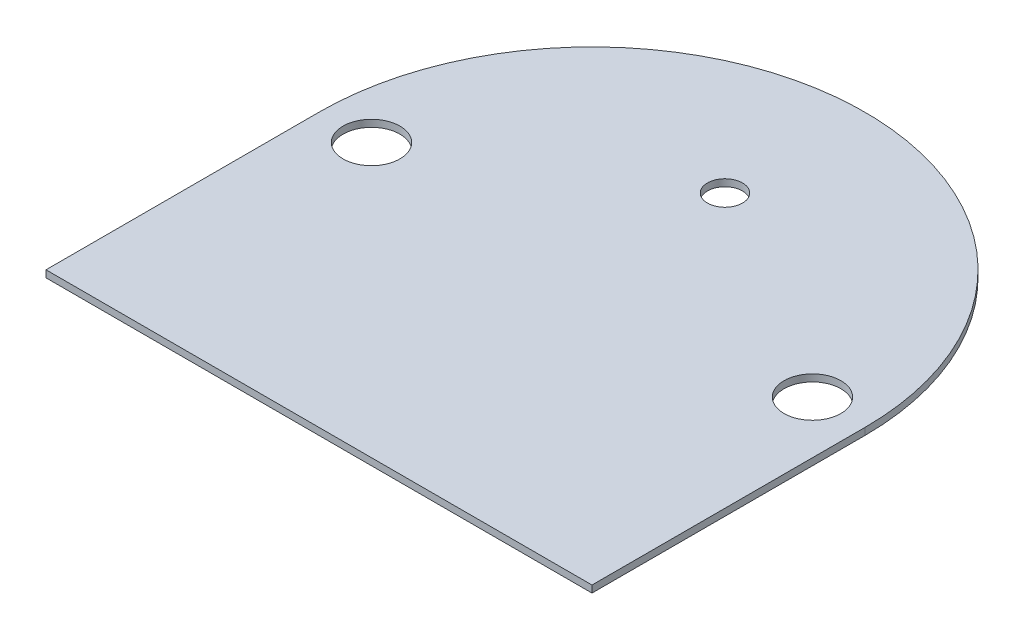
ISO-10303-21;
HEADER;
FILE_DESCRIPTION(('STEP AP214'),'2;1');
FILE_NAME('part.step','',(''),(''),'','','');
FILE_SCHEMA(('AUTOMOTIVE_DESIGN { 1 0 10303 214 1 1 1 1 }'));
ENDSEC;
DATA;
#1=APPLICATION_CONTEXT('core data for automotive mechanical design processes');
#2=APPLICATION_PROTOCOL_DEFINITION('international standard','automotive_design',2000,#1);
#3=PRODUCT_CONTEXT('',#1,'mechanical');
#4=PRODUCT('Part','Part','',(#3));
#5=PRODUCT_RELATED_PRODUCT_CATEGORY('part','',(#4));
#6=PRODUCT_DEFINITION_FORMATION('','',#4);
#7=PRODUCT_DEFINITION_CONTEXT('part definition',#1,'design');
#8=PRODUCT_DEFINITION('design','',#6,#7);
#9=PRODUCT_DEFINITION_SHAPE('','',#8);
#10=(LENGTH_UNIT() NAMED_UNIT(*) SI_UNIT(.MILLI.,.METRE.));
#11=(NAMED_UNIT(*) PLANE_ANGLE_UNIT() SI_UNIT($,.RADIAN.));
#12=(NAMED_UNIT(*) SI_UNIT($,.STERADIAN.) SOLID_ANGLE_UNIT());
#13=UNCERTAINTY_MEASURE_WITH_UNIT(LENGTH_MEASURE(1.E-05),#10,'distance_accuracy_value','');
#14=(GEOMETRIC_REPRESENTATION_CONTEXT(3) GLOBAL_UNCERTAINTY_ASSIGNED_CONTEXT((#13)) GLOBAL_UNIT_ASSIGNED_CONTEXT((#10,
#11,#12)) REPRESENTATION_CONTEXT('',''));
#15=CARTESIAN_POINT('',(0.,0.,0.));
#16=DIRECTION('',(0.,0.,1.));
#17=DIRECTION('',(1.,0.,0.));
#18=AXIS2_PLACEMENT_3D('',#15,#16,#17);
#19=CARTESIAN_POINT('',(0.,2.54,0.));
#20=DIRECTION('',(0.,-1.,0.));
#21=DIRECTION('',(0.,0.,-1.));
#22=AXIS2_PLACEMENT_3D('',#19,#20,#21);
#23=CYLINDRICAL_SURFACE('',#22,99.06);
#24=CARTESIAN_POINT('',(0.,0.,0.));
#25=DIRECTION('',(0.,1.,0.));
#26=DIRECTION('',(0.,0.,1.));
#27=AXIS2_PLACEMENT_3D('',#24,#25,#26);
#28=CIRCLE('',#27,99.06);
#29=CARTESIAN_POINT('',(99.06,0.,0.));
#30=VERTEX_POINT('',#29);
#31=CARTESIAN_POINT('',(-99.06,0.,0.));
#32=VERTEX_POINT('',#31);
#33=EDGE_CURVE('E108',#30,#32,#28,.T.);
#34=ORIENTED_EDGE('',*,*,#33,.T.);
#35=DIRECTION('',(0.,-1.,0.));
#36=VECTOR('',#35,1.);
#37=CARTESIAN_POINT('',(-99.06,2.54,0.));
#38=LINE('',#37,#36);
#39=CARTESIAN_POINT('',(-99.06,2.54,0.));
#40=VERTEX_POINT('',#39);
#41=EDGE_CURVE('E11',#40,#32,#38,.T.);
#42=ORIENTED_EDGE('',*,*,#41,.F.);
#43=CARTESIAN_POINT('',(0.,2.54,0.));
#44=DIRECTION('',(0.,1.,0.));
#45=DIRECTION('',(0.,0.,1.));
#46=AXIS2_PLACEMENT_3D('',#43,#44,#45);
#47=CIRCLE('',#46,99.06);
#48=CARTESIAN_POINT('',(99.06,2.54,0.));
#49=VERTEX_POINT('',#48);
#50=EDGE_CURVE('E94',#49,#40,#47,.T.);
#51=ORIENTED_EDGE('',*,*,#50,.F.);
#52=DIRECTION('',(0.,-1.,0.));
#53=VECTOR('',#52,1.);
#54=CARTESIAN_POINT('',(99.06,2.54,0.));
#55=LINE('',#54,#53);
#56=EDGE_CURVE('E61',#49,#30,#55,.T.);
#57=ORIENTED_EDGE('',*,*,#56,.T.);
#58=EDGE_LOOP('',(#34,#42,#51,#57));
#59=FACE_BOUND('',#58,.T.);
#60=ADVANCED_FACE('F45',(#59),#23,.T.);
#61=CARTESIAN_POINT('',(-99.06,2.54,0.));
#62=DIRECTION('',(1.,0.,0.));
#63=DIRECTION('',(0.,0.,-1.));
#64=AXIS2_PLACEMENT_3D('',#61,#62,#63);
#65=PLANE('',#64);
#66=DIRECTION('',(0.,0.,1.));
#67=VECTOR('',#66,1.);
#68=CARTESIAN_POINT('',(-99.06,0.,0.));
#69=LINE('',#68,#67);
#70=CARTESIAN_POINT('',(-99.06,0.,99.06));
#71=VERTEX_POINT('',#70);
#72=EDGE_CURVE('E99',#32,#71,#69,.T.);
#73=ORIENTED_EDGE('',*,*,#72,.T.);
#74=DIRECTION('',(0.,-1.,0.));
#75=VECTOR('',#74,1.);
#76=CARTESIAN_POINT('',(-99.06,2.54,99.06));
#77=LINE('',#76,#75);
#78=CARTESIAN_POINT('',(-99.06,2.54,99.06));
#79=VERTEX_POINT('',#78);
#80=EDGE_CURVE('E53',#79,#71,#77,.T.);
#81=ORIENTED_EDGE('',*,*,#80,.F.);
#82=DIRECTION('',(0.,0.,1.));
#83=VECTOR('',#82,1.);
#84=CARTESIAN_POINT('',(-99.06,2.54,0.));
#85=LINE('',#84,#83);
#86=EDGE_CURVE('E87',#40,#79,#85,.T.);
#87=ORIENTED_EDGE('',*,*,#86,.F.);
#88=ORIENTED_EDGE('',*,*,#41,.T.);
#89=EDGE_LOOP('',(#73,#81,#87,#88));
#90=FACE_BOUND('',#89,.T.);
#91=ADVANCED_FACE('F98',(#90),#65,.F.);
#92=CARTESIAN_POINT('',(0.,2.54,99.06));
#93=DIRECTION('',(0.,0.,-1.));
#94=DIRECTION('',(-1.,0.,0.));
#95=AXIS2_PLACEMENT_3D('',#92,#93,#94);
#96=PLANE('',#95);
#97=DIRECTION('',(1.,0.,0.));
#98=VECTOR('',#97,1.);
#99=CARTESIAN_POINT('',(0.,0.,99.06));
#100=LINE('',#99,#98);
#101=CARTESIAN_POINT('',(99.06,0.,99.06));
#102=VERTEX_POINT('',#101);
#103=EDGE_CURVE('E112',#71,#102,#100,.T.);
#104=ORIENTED_EDGE('',*,*,#103,.T.);
#105=DIRECTION('',(0.,-1.,0.));
#106=VECTOR('',#105,1.);
#107=CARTESIAN_POINT('',(99.06,2.54,99.06));
#108=LINE('',#107,#106);
#109=CARTESIAN_POINT('',(99.06,2.54,99.06));
#110=VERTEX_POINT('',#109);
#111=EDGE_CURVE('E76',#110,#102,#108,.T.);
#112=ORIENTED_EDGE('',*,*,#111,.F.);
#113=DIRECTION('',(1.,0.,0.));
#114=VECTOR('',#113,1.);
#115=CARTESIAN_POINT('',(0.,2.54,99.06));
#116=LINE('',#115,#114);
#117=EDGE_CURVE('E93',#79,#110,#116,.T.);
#118=ORIENTED_EDGE('',*,*,#117,.F.);
#119=ORIENTED_EDGE('',*,*,#80,.T.);
#120=EDGE_LOOP('',(#104,#112,#118,#119));
#121=FACE_BOUND('',#120,.T.);
#122=ADVANCED_FACE('F102',(#121),#96,.F.);
#123=CARTESIAN_POINT('',(99.06,2.54,0.));
#124=DIRECTION('',(1.,0.,0.));
#125=DIRECTION('',(0.,0.,-1.));
#126=AXIS2_PLACEMENT_3D('',#123,#124,#125);
#127=PLANE('',#126);
#128=DIRECTION('',(0.,0.,1.));
#129=VECTOR('',#128,1.);
#130=CARTESIAN_POINT('',(99.06,0.,0.));
#131=LINE('',#130,#129);
#132=EDGE_CURVE('E114',#30,#102,#131,.T.);
#133=ORIENTED_EDGE('',*,*,#132,.F.);
#134=ORIENTED_EDGE('',*,*,#56,.F.);
#135=DIRECTION('',(0.,0.,1.));
#136=VECTOR('',#135,1.);
#137=CARTESIAN_POINT('',(99.06,2.54,0.));
#138=LINE('',#137,#136);
#139=EDGE_CURVE('E103',#49,#110,#138,.T.);
#140=ORIENTED_EDGE('',*,*,#139,.T.);
#141=ORIENTED_EDGE('',*,*,#111,.T.);
#142=EDGE_LOOP('',(#133,#134,#140,#141));
#143=FACE_BOUND('',#142,.T.);
#144=ADVANCED_FACE('F150',(#143),#127,.T.);
#145=CARTESIAN_POINT('',(0.,2.54,0.));
#146=DIRECTION('',(0.,1.,0.));
#147=DIRECTION('',(0.,0.,1.));
#148=AXIS2_PLACEMENT_3D('',#145,#146,#147);
#149=PLANE('',#148);
#150=CARTESIAN_POINT('',(-80.01,2.54,0.));
#151=DIRECTION('',(0.,1.,0.));
#152=DIRECTION('',(0.,0.,1.));
#153=AXIS2_PLACEMENT_3D('',#150,#151,#152);
#154=CIRCLE('',#153,10.31875);
#155=CARTESIAN_POINT('',(-80.01,2.54,10.31875));
#156=VERTEX_POINT('',#155);
#157=EDGE_CURVE('E132',#156,#156,#154,.T.);
#158=ORIENTED_EDGE('',*,*,#157,.F.);
#159=EDGE_LOOP('',(#158));
#160=FACE_BOUND('',#159,.T.);
#161=CARTESIAN_POINT('',(80.01,2.54,0.));
#162=DIRECTION('',(0.,1.,0.));
#163=DIRECTION('',(0.,0.,-1.));
#164=AXIS2_PLACEMENT_3D('',#161,#162,#163);
#165=CIRCLE('',#164,10.31875);
#166=CARTESIAN_POINT('',(80.01,2.54,-10.31875));
#167=VERTEX_POINT('',#166);
#168=EDGE_CURVE('E129',#167,#167,#165,.T.);
#169=ORIENTED_EDGE('',*,*,#168,.F.);
#170=EDGE_LOOP('',(#169));
#171=FACE_BOUND('',#170,.T.);
#172=CARTESIAN_POINT('',(0.,2.54,-48.26));
#173=DIRECTION('',(0.,1.,0.));
#174=DIRECTION('',(0.,0.,1.));
#175=AXIS2_PLACEMENT_3D('',#172,#173,#174);
#176=CIRCLE('',#175,6.35);
#177=CARTESIAN_POINT('',(0.,2.54,-41.91));
#178=VERTEX_POINT('',#177);
#179=EDGE_CURVE('E123',#178,#178,#176,.T.);
#180=ORIENTED_EDGE('',*,*,#179,.F.);
#181=EDGE_LOOP('',(#180));
#182=FACE_BOUND('',#181,.T.);
#183=ORIENTED_EDGE('',*,*,#50,.T.);
#184=ORIENTED_EDGE('',*,*,#86,.T.);
#185=ORIENTED_EDGE('',*,*,#117,.T.);
#186=ORIENTED_EDGE('',*,*,#139,.F.);
#187=EDGE_LOOP('',(#183,#184,#185,#186));
#188=FACE_BOUND('',#187,.T.);
#189=ADVANCED_FACE('F90',(#160,#171,#182,#188),#149,.T.);
#190=CARTESIAN_POINT('',(0.,0.,0.));
#191=DIRECTION('',(0.,1.,0.));
#192=DIRECTION('',(0.,0.,1.));
#193=AXIS2_PLACEMENT_3D('',#190,#191,#192);
#194=PLANE('',#193);
#195=CARTESIAN_POINT('',(-80.01,0.,0.));
#196=DIRECTION('',(0.,1.,0.));
#197=DIRECTION('',(0.,0.,1.));
#198=AXIS2_PLACEMENT_3D('',#195,#196,#197);
#199=CIRCLE('',#198,10.31875);
#200=CARTESIAN_POINT('',(-80.01,0.,10.31875));
#201=VERTEX_POINT('',#200);
#202=EDGE_CURVE('E110',#201,#201,#199,.T.);
#203=ORIENTED_EDGE('',*,*,#202,.T.);
#204=EDGE_LOOP('',(#203));
#205=FACE_BOUND('',#204,.T.);
#206=CARTESIAN_POINT('',(80.01,0.,0.));
#207=DIRECTION('',(0.,1.,0.));
#208=DIRECTION('',(0.,0.,-1.));
#209=AXIS2_PLACEMENT_3D('',#206,#207,#208);
#210=CIRCLE('',#209,10.31875);
#211=CARTESIAN_POINT('',(80.01,0.,-10.31875));
#212=VERTEX_POINT('',#211);
#213=EDGE_CURVE('E126',#212,#212,#210,.T.);
#214=ORIENTED_EDGE('',*,*,#213,.T.);
#215=EDGE_LOOP('',(#214));
#216=FACE_BOUND('',#215,.T.);
#217=CARTESIAN_POINT('',(0.,0.,-48.26));
#218=DIRECTION('',(0.,1.,0.));
#219=DIRECTION('',(0.,0.,1.));
#220=AXIS2_PLACEMENT_3D('',#217,#218,#219);
#221=CIRCLE('',#220,6.35);
#222=CARTESIAN_POINT('',(0.,0.,-41.91));
#223=VERTEX_POINT('',#222);
#224=EDGE_CURVE('E120',#223,#223,#221,.T.);
#225=ORIENTED_EDGE('',*,*,#224,.T.);
#226=EDGE_LOOP('',(#225));
#227=FACE_BOUND('',#226,.T.);
#228=ORIENTED_EDGE('',*,*,#33,.F.);
#229=ORIENTED_EDGE('',*,*,#132,.T.);
#230=ORIENTED_EDGE('',*,*,#103,.F.);
#231=ORIENTED_EDGE('',*,*,#72,.F.);
#232=EDGE_LOOP('',(#228,#229,#230,#231));
#233=FACE_BOUND('',#232,.T.);
#234=ADVANCED_FACE('F138',(#205,#216,#227,#233),#194,.F.);
#235=CARTESIAN_POINT('',(0.,0.,-48.26));
#236=DIRECTION('',(0.,1.,0.));
#237=DIRECTION('',(0.,0.,1.));
#238=AXIS2_PLACEMENT_3D('',#235,#236,#237);
#239=CYLINDRICAL_SURFACE('',#238,6.35);
#240=ORIENTED_EDGE('',*,*,#224,.F.);
#241=EDGE_LOOP('',(#240));
#242=FACE_BOUND('',#241,.T.);
#243=ORIENTED_EDGE('',*,*,#179,.T.);
#244=EDGE_LOOP('',(#243));
#245=FACE_BOUND('',#244,.T.);
#246=ADVANCED_FACE('F156',(#242,#245),#239,.F.);
#247=CARTESIAN_POINT('',(80.01,0.,0.));
#248=DIRECTION('',(0.,1.,0.));
#249=DIRECTION('',(0.,0.,1.));
#250=AXIS2_PLACEMENT_3D('',#247,#248,#249);
#251=CYLINDRICAL_SURFACE('',#250,10.31875);
#252=ORIENTED_EDGE('',*,*,#213,.F.);
#253=EDGE_LOOP('',(#252));
#254=FACE_BOUND('',#253,.T.);
#255=ORIENTED_EDGE('',*,*,#168,.T.);
#256=EDGE_LOOP('',(#255));
#257=FACE_BOUND('',#256,.T.);
#258=ADVANCED_FACE('F144',(#254,#257),#251,.F.);
#259=CARTESIAN_POINT('',(-80.01,0.,0.));
#260=DIRECTION('',(0.,1.,0.));
#261=DIRECTION('',(0.,0.,1.));
#262=AXIS2_PLACEMENT_3D('',#259,#260,#261);
#263=CYLINDRICAL_SURFACE('',#262,10.31875);
#264=ORIENTED_EDGE('',*,*,#202,.F.);
#265=EDGE_LOOP('',(#264));
#266=FACE_BOUND('',#265,.T.);
#267=ORIENTED_EDGE('',*,*,#157,.T.);
#268=EDGE_LOOP('',(#267));
#269=FACE_BOUND('',#268,.T.);
#270=ADVANCED_FACE('F141',(#266,#269),#263,.F.);
#271=CLOSED_SHELL('',(#60,#91,#122,#144,#189,#234,#246,#258,#270));
#272=MANIFOLD_SOLID_BREP('B2',#271);
#273=ADVANCED_BREP_SHAPE_REPRESENTATION('',(#18,#272),#14);
#274=SHAPE_DEFINITION_REPRESENTATION(#9,#273);
ENDSEC;
END-ISO-10303-21;
